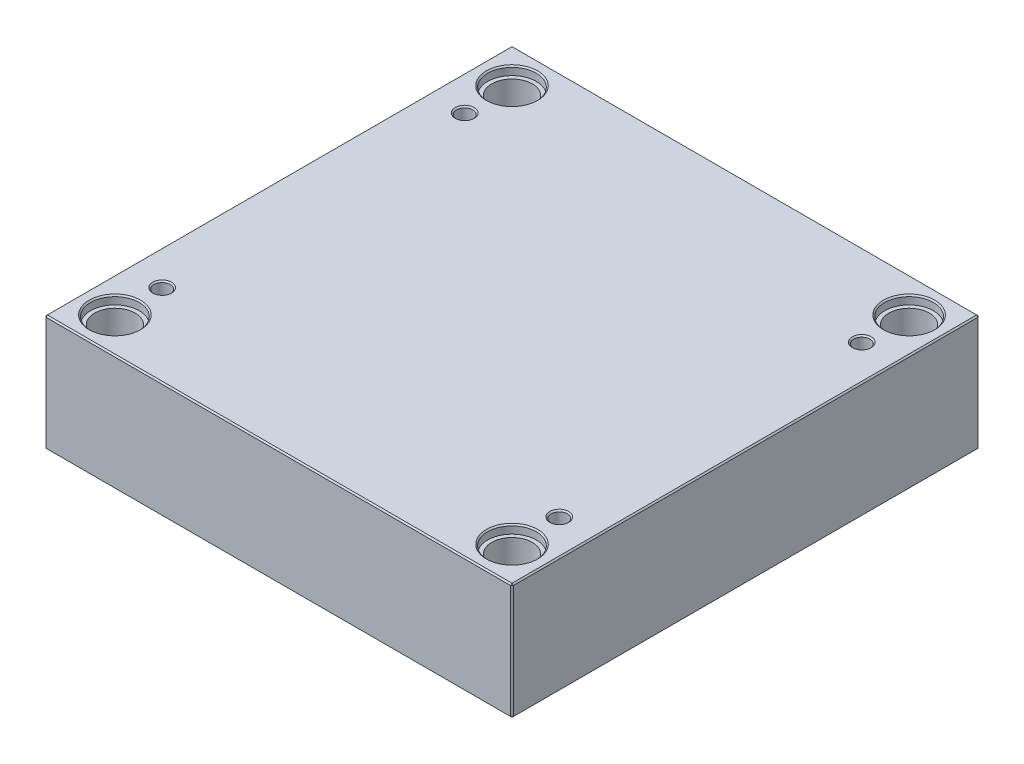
ISO-10303-21;
HEADER;
FILE_DESCRIPTION(('STEP AP214'),'2;1');
FILE_NAME('part.step','',(''),(''),'','','');
FILE_SCHEMA(('AUTOMOTIVE_DESIGN { 1 0 10303 214 1 1 1 1 }'));
ENDSEC;
DATA;
#1=APPLICATION_CONTEXT('core data for automotive mechanical design processes');
#2=APPLICATION_PROTOCOL_DEFINITION('international standard','automotive_design',2000,#1);
#3=PRODUCT_CONTEXT('',#1,'mechanical');
#4=PRODUCT('Part','Part','',(#3));
#5=PRODUCT_RELATED_PRODUCT_CATEGORY('part','',(#4));
#6=PRODUCT_DEFINITION_FORMATION('','',#4);
#7=PRODUCT_DEFINITION_CONTEXT('part definition',#1,'design');
#8=PRODUCT_DEFINITION('design','',#6,#7);
#9=PRODUCT_DEFINITION_SHAPE('','',#8);
#10=(LENGTH_UNIT() NAMED_UNIT(*) SI_UNIT(.MILLI.,.METRE.));
#11=(NAMED_UNIT(*) PLANE_ANGLE_UNIT() SI_UNIT($,.RADIAN.));
#12=(NAMED_UNIT(*) SI_UNIT($,.STERADIAN.) SOLID_ANGLE_UNIT());
#13=UNCERTAINTY_MEASURE_WITH_UNIT(LENGTH_MEASURE(1.E-05),#10,'distance_accuracy_value','');
#14=(GEOMETRIC_REPRESENTATION_CONTEXT(3) GLOBAL_UNCERTAINTY_ASSIGNED_CONTEXT((#13)) GLOBAL_UNIT_ASSIGNED_CONTEXT((#10,
#11,#12)) REPRESENTATION_CONTEXT('',''));
#15=CARTESIAN_POINT('',(0.,0.,0.));
#16=DIRECTION('',(0.,0.,1.));
#17=DIRECTION('',(1.,0.,0.));
#18=AXIS2_PLACEMENT_3D('',#15,#16,#17);
#19=CARTESIAN_POINT('',(-147.,0.,-147.));
#20=DIRECTION('',(0.,1.,0.));
#21=DIRECTION('',(0.,0.,1.));
#22=AXIS2_PLACEMENT_3D('',#19,#20,#21);
#23=CYLINDRICAL_SURFACE('',#22,15.);
#24=CARTESIAN_POINT('',(-147.,1.00000000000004,-147.));
#25=DIRECTION('',(0.,1.,0.));
#26=DIRECTION('',(0.,0.,1.));
#27=AXIS2_PLACEMENT_3D('',#24,#25,#26);
#28=CIRCLE('',#27,15.);
#29=CARTESIAN_POINT('',(-147.,1.00000000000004,-132.));
#30=VERTEX_POINT('',#29);
#31=EDGE_CURVE('E472',#30,#30,#28,.F.);
#32=ORIENTED_EDGE('',*,*,#31,.T.);
#33=EDGE_LOOP('',(#32));
#34=FACE_BOUND('',#33,.T.);
#35=CARTESIAN_POINT('',(-147.,79.7,-147.));
#36=DIRECTION('',(0.,1.,0.));
#37=DIRECTION('',(0.,0.,1.));
#38=AXIS2_PLACEMENT_3D('',#35,#36,#37);
#39=CIRCLE('',#38,15.);
#40=CARTESIAN_POINT('',(-147.,79.7,-132.));
#41=VERTEX_POINT('',#40);
#42=EDGE_CURVE('E221',#41,#41,#39,.F.);
#43=ORIENTED_EDGE('',*,*,#42,.F.);
#44=EDGE_LOOP('',(#43));
#45=FACE_BOUND('',#44,.T.);
#46=ADVANCED_FACE('F16',(#34,#45),#23,.F.);
#47=CARTESIAN_POINT('',(147.,0.,-147.));
#48=DIRECTION('',(0.,1.,0.));
#49=DIRECTION('',(0.,0.,1.));
#50=AXIS2_PLACEMENT_3D('',#47,#48,#49);
#51=CYLINDRICAL_SURFACE('',#50,15.);
#52=CARTESIAN_POINT('',(147.,1.00000000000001,-147.));
#53=DIRECTION('',(0.,1.,0.));
#54=DIRECTION('',(0.,0.,1.));
#55=AXIS2_PLACEMENT_3D('',#52,#53,#54);
#56=CIRCLE('',#55,15.);
#57=CARTESIAN_POINT('',(147.,1.00000000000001,-132.));
#58=VERTEX_POINT('',#57);
#59=EDGE_CURVE('E474',#58,#58,#56,.F.);
#60=ORIENTED_EDGE('',*,*,#59,.T.);
#61=EDGE_LOOP('',(#60));
#62=FACE_BOUND('',#61,.T.);
#63=CARTESIAN_POINT('',(147.,79.7,-147.));
#64=DIRECTION('',(0.,1.,0.));
#65=DIRECTION('',(0.,0.,1.));
#66=AXIS2_PLACEMENT_3D('',#63,#64,#65);
#67=CIRCLE('',#66,15.);
#68=CARTESIAN_POINT('',(147.,79.7,-132.));
#69=VERTEX_POINT('',#68);
#70=EDGE_CURVE('E218',#69,#69,#67,.F.);
#71=ORIENTED_EDGE('',*,*,#70,.F.);
#72=EDGE_LOOP('',(#71));
#73=FACE_BOUND('',#72,.T.);
#74=ADVANCED_FACE('F263',(#62,#73),#51,.F.);
#75=CARTESIAN_POINT('',(147.,0.,147.));
#76=DIRECTION('',(0.,1.,0.));
#77=DIRECTION('',(0.,0.,1.));
#78=AXIS2_PLACEMENT_3D('',#75,#76,#77);
#79=CYLINDRICAL_SURFACE('',#78,15.);
#80=CARTESIAN_POINT('',(147.,1.00000000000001,147.));
#81=DIRECTION('',(0.,1.,0.));
#82=DIRECTION('',(0.,0.,1.));
#83=AXIS2_PLACEMENT_3D('',#80,#81,#82);
#84=CIRCLE('',#83,15.);
#85=CARTESIAN_POINT('',(147.,1.00000000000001,162.));
#86=VERTEX_POINT('',#85);
#87=EDGE_CURVE('E477',#86,#86,#84,.F.);
#88=ORIENTED_EDGE('',*,*,#87,.T.);
#89=EDGE_LOOP('',(#88));
#90=FACE_BOUND('',#89,.T.);
#91=CARTESIAN_POINT('',(147.,79.7,147.));
#92=DIRECTION('',(0.,1.,0.));
#93=DIRECTION('',(0.,0.,1.));
#94=AXIS2_PLACEMENT_3D('',#91,#92,#93);
#95=CIRCLE('',#94,15.);
#96=CARTESIAN_POINT('',(147.,79.7,162.));
#97=VERTEX_POINT('',#96);
#98=EDGE_CURVE('E214',#97,#97,#95,.F.);
#99=ORIENTED_EDGE('',*,*,#98,.F.);
#100=EDGE_LOOP('',(#99));
#101=FACE_BOUND('',#100,.T.);
#102=ADVANCED_FACE('F270',(#90,#101),#79,.F.);
#103=CARTESIAN_POINT('',(-147.,0.,147.));
#104=DIRECTION('',(0.,1.,0.));
#105=DIRECTION('',(0.,0.,1.));
#106=AXIS2_PLACEMENT_3D('',#103,#104,#105);
#107=CYLINDRICAL_SURFACE('',#106,15.);
#108=CARTESIAN_POINT('',(-147.,1.00000000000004,147.));
#109=DIRECTION('',(0.,1.,0.));
#110=DIRECTION('',(0.,0.,1.));
#111=AXIS2_PLACEMENT_3D('',#108,#109,#110);
#112=CIRCLE('',#111,15.);
#113=CARTESIAN_POINT('',(-147.,1.00000000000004,162.));
#114=VERTEX_POINT('',#113);
#115=EDGE_CURVE('E480',#114,#114,#112,.F.);
#116=ORIENTED_EDGE('',*,*,#115,.T.);
#117=EDGE_LOOP('',(#116));
#118=FACE_BOUND('',#117,.T.);
#119=CARTESIAN_POINT('',(-147.,79.7,147.));
#120=DIRECTION('',(0.,1.,0.));
#121=DIRECTION('',(0.,0.,1.));
#122=AXIS2_PLACEMENT_3D('',#119,#120,#121);
#123=CIRCLE('',#122,15.);
#124=CARTESIAN_POINT('',(-147.,79.7,162.));
#125=VERTEX_POINT('',#124);
#126=EDGE_CURVE('E211',#125,#125,#123,.F.);
#127=ORIENTED_EDGE('',*,*,#126,.F.);
#128=EDGE_LOOP('',(#127));
#129=FACE_BOUND('',#128,.T.);
#130=ADVANCED_FACE('F277',(#118,#129),#107,.F.);
#131=CARTESIAN_POINT('',(-173.,86.,173.));
#132=DIRECTION('',(1.,0.,0.));
#133=DIRECTION('',(0.,0.,-1.));
#134=AXIS2_PLACEMENT_3D('',#131,#132,#133);
#135=PLANE('',#134);
#136=DIRECTION('',(0.,-1.,0.));
#137=VECTOR('',#136,1.);
#138=CARTESIAN_POINT('',(-173.,86.,-172.));
#139=LINE('',#138,#137);
#140=CARTESIAN_POINT('',(-173.,85.,-172.));
#141=VERTEX_POINT('',#140);
#142=CARTESIAN_POINT('',(-173.,1.00000000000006,-172.));
#143=VERTEX_POINT('',#142);
#144=EDGE_CURVE('E487',#141,#143,#139,.T.);
#145=ORIENTED_EDGE('',*,*,#144,.T.);
#146=DIRECTION('',(0.,0.,1.));
#147=VECTOR('',#146,1.);
#148=CARTESIAN_POINT('',(-173.,1.00000000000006,173.));
#149=LINE('',#148,#147);
#150=CARTESIAN_POINT('',(-173.,1.00000000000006,172.));
#151=VERTEX_POINT('',#150);
#152=EDGE_CURVE('E490',#143,#151,#149,.T.);
#153=ORIENTED_EDGE('',*,*,#152,.T.);
#154=DIRECTION('',(0.,1.,0.));
#155=VECTOR('',#154,1.);
#156=CARTESIAN_POINT('',(-173.,86.,172.));
#157=LINE('',#156,#155);
#158=CARTESIAN_POINT('',(-173.,85.,172.));
#159=VERTEX_POINT('',#158);
#160=EDGE_CURVE('E485',#151,#159,#157,.T.);
#161=ORIENTED_EDGE('',*,*,#160,.T.);
#162=DIRECTION('',(0.,0.,-1.));
#163=VECTOR('',#162,1.);
#164=CARTESIAN_POINT('',(-173.,85.,-173.));
#165=LINE('',#164,#163);
#166=EDGE_CURVE('E483',#159,#141,#165,.T.);
#167=ORIENTED_EDGE('',*,*,#166,.T.);
#168=EDGE_LOOP('',(#145,#153,#161,#167));
#169=FACE_BOUND('',#168,.T.);
#170=ADVANCED_FACE('F298',(#169),#135,.F.);
#171=CARTESIAN_POINT('',(173.,86.,173.));
#172=DIRECTION('',(0.,0.,-1.));
#173=DIRECTION('',(-1.,0.,0.));
#174=AXIS2_PLACEMENT_3D('',#171,#172,#173);
#175=PLANE('',#174);
#176=DIRECTION('',(-1.,0.,0.));
#177=VECTOR('',#176,1.);
#178=CARTESIAN_POINT('',(-173.,85.,173.));
#179=LINE('',#178,#177);
#180=CARTESIAN_POINT('',(172.,85.,173.));
#181=VERTEX_POINT('',#180);
#182=CARTESIAN_POINT('',(-172.,85.,173.));
#183=VERTEX_POINT('',#182);
#184=EDGE_CURVE('E509',#181,#183,#179,.T.);
#185=ORIENTED_EDGE('',*,*,#184,.T.);
#186=DIRECTION('',(0.,-1.,0.));
#187=VECTOR('',#186,1.);
#188=CARTESIAN_POINT('',(-172.,86.,173.));
#189=LINE('',#188,#187);
#190=CARTESIAN_POINT('',(-172.,1.00000000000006,173.));
#191=VERTEX_POINT('',#190);
#192=EDGE_CURVE('E515',#183,#191,#189,.T.);
#193=ORIENTED_EDGE('',*,*,#192,.T.);
#194=DIRECTION('',(1.,0.,0.));
#195=VECTOR('',#194,1.);
#196=CARTESIAN_POINT('',(173.,1.00000000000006,173.));
#197=LINE('',#196,#195);
#198=CARTESIAN_POINT('',(172.,1.00000000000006,173.));
#199=VERTEX_POINT('',#198);
#200=EDGE_CURVE('E513',#191,#199,#197,.T.);
#201=ORIENTED_EDGE('',*,*,#200,.T.);
#202=DIRECTION('',(0.,1.,0.));
#203=VECTOR('',#202,1.);
#204=CARTESIAN_POINT('',(172.,86.,173.));
#205=LINE('',#204,#203);
#206=EDGE_CURVE('E511',#199,#181,#205,.T.);
#207=ORIENTED_EDGE('',*,*,#206,.T.);
#208=EDGE_LOOP('',(#185,#193,#201,#207));
#209=FACE_BOUND('',#208,.T.);
#210=ADVANCED_FACE('F294',(#209),#175,.F.);
#211=CARTESIAN_POINT('',(173.,86.,173.));
#212=DIRECTION('',(-1.,0.,0.));
#213=DIRECTION('',(0.,0.,1.));
#214=AXIS2_PLACEMENT_3D('',#211,#212,#213);
#215=PLANE('',#214);
#216=DIRECTION('',(0.,0.,-1.));
#217=VECTOR('',#216,1.);
#218=CARTESIAN_POINT('',(173.,1.00000000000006,173.));
#219=LINE('',#218,#217);
#220=CARTESIAN_POINT('',(173.,1.00000000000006,172.));
#221=VERTEX_POINT('',#220);
#222=CARTESIAN_POINT('',(173.,1.00000000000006,-172.));
#223=VERTEX_POINT('',#222);
#224=EDGE_CURVE('E504',#221,#223,#219,.T.);
#225=ORIENTED_EDGE('',*,*,#224,.T.);
#226=DIRECTION('',(0.,1.,0.));
#227=VECTOR('',#226,1.);
#228=CARTESIAN_POINT('',(173.,86.,-172.));
#229=LINE('',#228,#227);
#230=CARTESIAN_POINT('',(173.,85.,-172.));
#231=VERTEX_POINT('',#230);
#232=EDGE_CURVE('E506',#223,#231,#229,.T.);
#233=ORIENTED_EDGE('',*,*,#232,.T.);
#234=DIRECTION('',(0.,0.,1.));
#235=VECTOR('',#234,1.);
#236=CARTESIAN_POINT('',(173.,85.,173.));
#237=LINE('',#236,#235);
#238=CARTESIAN_POINT('',(173.,85.,172.));
#239=VERTEX_POINT('',#238);
#240=EDGE_CURVE('E500',#231,#239,#237,.T.);
#241=ORIENTED_EDGE('',*,*,#240,.T.);
#242=DIRECTION('',(0.,-1.,0.));
#243=VECTOR('',#242,1.);
#244=CARTESIAN_POINT('',(173.,86.,172.));
#245=LINE('',#244,#243);
#246=EDGE_CURVE('E502',#239,#221,#245,.T.);
#247=ORIENTED_EDGE('',*,*,#246,.T.);
#248=EDGE_LOOP('',(#225,#233,#241,#247));
#249=FACE_BOUND('',#248,.T.);
#250=ADVANCED_FACE('F290',(#249),#215,.F.);
#251=CARTESIAN_POINT('',(173.,86.,-173.));
#252=DIRECTION('',(0.,0.,1.));
#253=DIRECTION('',(1.,0.,0.));
#254=AXIS2_PLACEMENT_3D('',#251,#252,#253);
#255=PLANE('',#254);
#256=DIRECTION('',(0.,-1.,0.));
#257=VECTOR('',#256,1.);
#258=CARTESIAN_POINT('',(172.,86.,-173.));
#259=LINE('',#258,#257);
#260=CARTESIAN_POINT('',(172.,85.,-173.));
#261=VERTEX_POINT('',#260);
#262=CARTESIAN_POINT('',(172.,1.00000000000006,-173.));
#263=VERTEX_POINT('',#262);
#264=EDGE_CURVE('E494',#261,#263,#259,.T.);
#265=ORIENTED_EDGE('',*,*,#264,.T.);
#266=DIRECTION('',(-1.,0.,0.));
#267=VECTOR('',#266,1.);
#268=CARTESIAN_POINT('',(173.,1.00000000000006,-173.));
#269=LINE('',#268,#267);
#270=CARTESIAN_POINT('',(-172.,1.00000000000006,-173.));
#271=VERTEX_POINT('',#270);
#272=EDGE_CURVE('E138',#263,#271,#269,.T.);
#273=ORIENTED_EDGE('',*,*,#272,.T.);
#274=DIRECTION('',(0.,1.,0.));
#275=VECTOR('',#274,1.);
#276=CARTESIAN_POINT('',(-172.,86.,-173.));
#277=LINE('',#276,#275);
#278=CARTESIAN_POINT('',(-172.,85.,-173.));
#279=VERTEX_POINT('',#278);
#280=EDGE_CURVE('E496',#271,#279,#277,.T.);
#281=ORIENTED_EDGE('',*,*,#280,.T.);
#282=DIRECTION('',(1.,0.,0.));
#283=VECTOR('',#282,1.);
#284=CARTESIAN_POINT('',(173.,85.,-173.));
#285=LINE('',#284,#283);
#286=EDGE_CURVE('E492',#279,#261,#285,.T.);
#287=ORIENTED_EDGE('',*,*,#286,.T.);
#288=EDGE_LOOP('',(#265,#273,#281,#287));
#289=FACE_BOUND('',#288,.T.);
#290=ADVANCED_FACE('F282',(#289),#255,.F.);
#291=CARTESIAN_POINT('',(0.,86.,0.));
#292=DIRECTION('',(0.,1.,0.));
#293=DIRECTION('',(0.,0.,1.));
#294=AXIS2_PLACEMENT_3D('',#291,#292,#293);
#295=PLANE('',#294);
#296=CARTESIAN_POINT('',(147.,86.,147.));
#297=DIRECTION('',(0.,1.,0.));
#298=DIRECTION('',(0.,0.,1.));
#299=AXIS2_PLACEMENT_3D('',#296,#297,#298);
#300=CIRCLE('',#299,19.);
#301=CARTESIAN_POINT('',(147.,86.,166.));
#302=VERTEX_POINT('',#301);
#303=EDGE_CURVE('E236',#302,#302,#300,.F.);
#304=ORIENTED_EDGE('',*,*,#303,.T.);
#305=EDGE_LOOP('',(#304));
#306=FACE_BOUND('',#305,.T.);
#307=CARTESIAN_POINT('',(-147.,86.,147.));
#308=DIRECTION('',(0.,1.,0.));
#309=DIRECTION('',(0.,0.,1.));
#310=AXIS2_PLACEMENT_3D('',#307,#308,#309);
#311=CIRCLE('',#310,19.);
#312=CARTESIAN_POINT('',(-147.,86.,166.));
#313=VERTEX_POINT('',#312);
#314=EDGE_CURVE('E233',#313,#313,#311,.F.);
#315=ORIENTED_EDGE('',*,*,#314,.T.);
#316=EDGE_LOOP('',(#315));
#317=FACE_BOUND('',#316,.T.);
#318=CARTESIAN_POINT('',(147.,86.,-147.));
#319=DIRECTION('',(0.,1.,0.));
#320=DIRECTION('',(0.,0.,1.));
#321=AXIS2_PLACEMENT_3D('',#318,#319,#320);
#322=CIRCLE('',#321,19.);
#323=CARTESIAN_POINT('',(147.,86.,-128.));
#324=VERTEX_POINT('',#323);
#325=EDGE_CURVE('E230',#324,#324,#322,.F.);
#326=ORIENTED_EDGE('',*,*,#325,.T.);
#327=EDGE_LOOP('',(#326));
#328=FACE_BOUND('',#327,.T.);
#329=CARTESIAN_POINT('',(-147.,86.,-147.));
#330=DIRECTION('',(0.,1.,0.));
#331=DIRECTION('',(0.,0.,1.));
#332=AXIS2_PLACEMENT_3D('',#329,#330,#331);
#333=CIRCLE('',#332,19.);
#334=CARTESIAN_POINT('',(-147.,86.,-128.));
#335=VERTEX_POINT('',#334);
#336=EDGE_CURVE('E227',#335,#335,#333,.F.);
#337=ORIENTED_EDGE('',*,*,#336,.T.);
#338=EDGE_LOOP('',(#337));
#339=FACE_BOUND('',#338,.T.);
#340=CARTESIAN_POINT('',(-147.,86.,112.));
#341=DIRECTION('',(0.,1.,0.));
#342=DIRECTION('',(0.,0.,1.));
#343=AXIS2_PLACEMENT_3D('',#340,#341,#342);
#344=CIRCLE('',#343,7.);
#345=CARTESIAN_POINT('',(-147.,86.,119.));
#346=VERTEX_POINT('',#345);
#347=EDGE_CURVE('E198',#346,#346,#344,.F.);
#348=ORIENTED_EDGE('',*,*,#347,.T.);
#349=EDGE_LOOP('',(#348));
#350=FACE_BOUND('',#349,.T.);
#351=CARTESIAN_POINT('',(147.,86.,112.));
#352=DIRECTION('',(0.,1.,0.));
#353=DIRECTION('',(0.,0.,1.));
#354=AXIS2_PLACEMENT_3D('',#351,#352,#353);
#355=CIRCLE('',#354,7.);
#356=CARTESIAN_POINT('',(147.,86.,119.));
#357=VERTEX_POINT('',#356);
#358=EDGE_CURVE('E195',#357,#357,#355,.F.);
#359=ORIENTED_EDGE('',*,*,#358,.T.);
#360=EDGE_LOOP('',(#359));
#361=FACE_BOUND('',#360,.T.);
#362=CARTESIAN_POINT('',(147.,86.,-112.));
#363=DIRECTION('',(0.,1.,0.));
#364=DIRECTION('',(0.,0.,1.));
#365=AXIS2_PLACEMENT_3D('',#362,#363,#364);
#366=CIRCLE('',#365,7.);
#367=CARTESIAN_POINT('',(147.,86.,-105.));
#368=VERTEX_POINT('',#367);
#369=EDGE_CURVE('E192',#368,#368,#366,.F.);
#370=ORIENTED_EDGE('',*,*,#369,.T.);
#371=EDGE_LOOP('',(#370));
#372=FACE_BOUND('',#371,.T.);
#373=CARTESIAN_POINT('',(-147.,86.,-112.));
#374=DIRECTION('',(0.,1.,0.));
#375=DIRECTION('',(0.,0.,1.));
#376=AXIS2_PLACEMENT_3D('',#373,#374,#375);
#377=CIRCLE('',#376,7.);
#378=CARTESIAN_POINT('',(-147.,86.,-105.));
#379=VERTEX_POINT('',#378);
#380=EDGE_CURVE('E188',#379,#379,#377,.F.);
#381=ORIENTED_EDGE('',*,*,#380,.T.);
#382=EDGE_LOOP('',(#381));
#383=FACE_BOUND('',#382,.T.);
#384=DIRECTION('',(0.,0.,-1.));
#385=VECTOR('',#384,1.);
#386=CARTESIAN_POINT('',(172.,86.,-173.));
#387=LINE('',#386,#385);
#388=CARTESIAN_POINT('',(172.,86.,172.));
#389=VERTEX_POINT('',#388);
#390=CARTESIAN_POINT('',(172.,86.,-172.));
#391=VERTEX_POINT('',#390);
#392=EDGE_CURVE('E31',#389,#391,#387,.T.);
#393=ORIENTED_EDGE('',*,*,#392,.T.);
#394=DIRECTION('',(-1.,0.,0.));
#395=VECTOR('',#394,1.);
#396=CARTESIAN_POINT('',(-173.,86.,-172.));
#397=LINE('',#396,#395);
#398=CARTESIAN_POINT('',(-172.,86.,-172.));
#399=VERTEX_POINT('',#398);
#400=EDGE_CURVE('E189',#391,#399,#397,.T.);
#401=ORIENTED_EDGE('',*,*,#400,.T.);
#402=DIRECTION('',(0.,0.,1.));
#403=VECTOR('',#402,1.);
#404=CARTESIAN_POINT('',(-172.,86.,173.));
#405=LINE('',#404,#403);
#406=CARTESIAN_POINT('',(-172.,86.,172.));
#407=VERTEX_POINT('',#406);
#408=EDGE_CURVE('E518',#399,#407,#405,.T.);
#409=ORIENTED_EDGE('',*,*,#408,.T.);
#410=DIRECTION('',(1.,0.,0.));
#411=VECTOR('',#410,1.);
#412=CARTESIAN_POINT('',(173.,86.,172.));
#413=LINE('',#412,#411);
#414=EDGE_CURVE('E36',#407,#389,#413,.T.);
#415=ORIENTED_EDGE('',*,*,#414,.T.);
#416=EDGE_LOOP('',(#393,#401,#409,#415));
#417=FACE_BOUND('',#416,.T.);
#418=ADVANCED_FACE('F279',(#306,#317,#328,#339,#350,#361,#372,#383,#417),#295,.T.);
#419=CARTESIAN_POINT('',(0.,0.,0.));
#420=DIRECTION('',(0.,1.,0.));
#421=DIRECTION('',(0.,0.,1.));
#422=AXIS2_PLACEMENT_3D('',#419,#420,#421);
#423=PLANE('',#422);
#424=CARTESIAN_POINT('',(-147.,0.,-147.));
#425=DIRECTION('',(0.,1.,0.));
#426=DIRECTION('',(0.,0.,1.));
#427=AXIS2_PLACEMENT_3D('',#424,#425,#426);
#428=CIRCLE('',#427,16.);
#429=CARTESIAN_POINT('',(-147.,0.,-131.));
#430=VERTEX_POINT('',#429);
#431=EDGE_CURVE('E469',#430,#430,#428,.T.);
#432=ORIENTED_EDGE('',*,*,#431,.T.);
#433=EDGE_LOOP('',(#432));
#434=FACE_BOUND('',#433,.T.);
#435=CARTESIAN_POINT('',(147.,0.,-147.));
#436=DIRECTION('',(0.,1.,0.));
#437=DIRECTION('',(0.,0.,1.));
#438=AXIS2_PLACEMENT_3D('',#435,#436,#437);
#439=CIRCLE('',#438,16.);
#440=CARTESIAN_POINT('',(147.,0.,-131.));
#441=VERTEX_POINT('',#440);
#442=EDGE_CURVE('E466',#441,#441,#439,.T.);
#443=ORIENTED_EDGE('',*,*,#442,.T.);
#444=EDGE_LOOP('',(#443));
#445=FACE_BOUND('',#444,.T.);
#446=CARTESIAN_POINT('',(147.,0.,147.));
#447=DIRECTION('',(0.,1.,0.));
#448=DIRECTION('',(0.,0.,1.));
#449=AXIS2_PLACEMENT_3D('',#446,#447,#448);
#450=CIRCLE('',#449,16.);
#451=CARTESIAN_POINT('',(147.,0.,163.));
#452=VERTEX_POINT('',#451);
#453=EDGE_CURVE('E463',#452,#452,#450,.T.);
#454=ORIENTED_EDGE('',*,*,#453,.T.);
#455=EDGE_LOOP('',(#454));
#456=FACE_BOUND('',#455,.T.);
#457=CARTESIAN_POINT('',(-147.,0.,147.));
#458=DIRECTION('',(0.,1.,0.));
#459=DIRECTION('',(0.,0.,1.));
#460=AXIS2_PLACEMENT_3D('',#457,#458,#459);
#461=CIRCLE('',#460,16.);
#462=CARTESIAN_POINT('',(-147.,0.,163.));
#463=VERTEX_POINT('',#462);
#464=EDGE_CURVE('E460',#463,#463,#461,.T.);
#465=ORIENTED_EDGE('',*,*,#464,.T.);
#466=EDGE_LOOP('',(#465));
#467=FACE_BOUND('',#466,.T.);
#468=DIRECTION('',(0.,0.,1.));
#469=VECTOR('',#468,1.);
#470=CARTESIAN_POINT('',(172.,0.,0.));
#471=LINE('',#470,#469);
#472=CARTESIAN_POINT('',(172.,0.,-172.));
#473=VERTEX_POINT('',#472);
#474=CARTESIAN_POINT('',(172.,0.,172.));
#475=VERTEX_POINT('',#474);
#476=EDGE_CURVE('E108',#473,#475,#471,.T.);
#477=ORIENTED_EDGE('',*,*,#476,.T.);
#478=DIRECTION('',(-1.,0.,0.));
#479=VECTOR('',#478,1.);
#480=CARTESIAN_POINT('',(0.,0.,172.));
#481=LINE('',#480,#479);
#482=CARTESIAN_POINT('',(-172.,0.,172.));
#483=VERTEX_POINT('',#482);
#484=EDGE_CURVE('E458',#475,#483,#481,.T.);
#485=ORIENTED_EDGE('',*,*,#484,.T.);
#486=DIRECTION('',(0.,0.,-1.));
#487=VECTOR('',#486,1.);
#488=CARTESIAN_POINT('',(-172.,0.,0.));
#489=LINE('',#488,#487);
#490=CARTESIAN_POINT('',(-172.,0.,-172.));
#491=VERTEX_POINT('',#490);
#492=EDGE_CURVE('E110',#483,#491,#489,.T.);
#493=ORIENTED_EDGE('',*,*,#492,.T.);
#494=DIRECTION('',(1.,0.,0.));
#495=VECTOR('',#494,1.);
#496=CARTESIAN_POINT('',(0.,0.,-172.));
#497=LINE('',#496,#495);
#498=EDGE_CURVE('E104',#491,#473,#497,.T.);
#499=ORIENTED_EDGE('',*,*,#498,.T.);
#500=EDGE_LOOP('',(#477,#485,#493,#499));
#501=FACE_BOUND('',#500,.T.);
#502=ADVANCED_FACE('F106',(#434,#445,#456,#467,#501),#423,.F.);
#503=CARTESIAN_POINT('',(-147.,0.,-147.));
#504=DIRECTION('',(0.,-1.,0.));
#505=DIRECTION('',(0.,0.,-1.));
#506=AXIS2_PLACEMENT_3D('',#503,#504,#505);
#507=CONICAL_SURFACE('',#506,16.,0.785398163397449);
#508=ORIENTED_EDGE('',*,*,#31,.F.);
#509=EDGE_LOOP('',(#508));
#510=FACE_BOUND('',#509,.T.);
#511=ORIENTED_EDGE('',*,*,#431,.F.);
#512=EDGE_LOOP('',(#511));
#513=FACE_BOUND('',#512,.T.);
#514=ADVANCED_FACE('F286',(#510,#513),#507,.F.);
#515=CARTESIAN_POINT('',(147.,0.,-147.));
#516=DIRECTION('',(0.,-1.,0.));
#517=DIRECTION('',(0.,0.,-1.));
#518=AXIS2_PLACEMENT_3D('',#515,#516,#517);
#519=CONICAL_SURFACE('',#518,16.,0.785398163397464);
#520=ORIENTED_EDGE('',*,*,#59,.F.);
#521=EDGE_LOOP('',(#520));
#522=FACE_BOUND('',#521,.T.);
#523=ORIENTED_EDGE('',*,*,#442,.F.);
#524=EDGE_LOOP('',(#523));
#525=FACE_BOUND('',#524,.T.);
#526=ADVANCED_FACE('F305',(#522,#525),#519,.F.);
#527=CARTESIAN_POINT('',(147.,0.,147.));
#528=DIRECTION('',(0.,-1.,0.));
#529=DIRECTION('',(0.,0.,-1.));
#530=AXIS2_PLACEMENT_3D('',#527,#528,#529);
#531=CONICAL_SURFACE('',#530,16.,0.78539816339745);
#532=ORIENTED_EDGE('',*,*,#87,.F.);
#533=EDGE_LOOP('',(#532));
#534=FACE_BOUND('',#533,.T.);
#535=ORIENTED_EDGE('',*,*,#453,.F.);
#536=EDGE_LOOP('',(#535));
#537=FACE_BOUND('',#536,.T.);
#538=ADVANCED_FACE('F309',(#534,#537),#531,.F.);
#539=CARTESIAN_POINT('',(-147.,0.,147.));
#540=DIRECTION('',(0.,-1.,0.));
#541=DIRECTION('',(0.,0.,-1.));
#542=AXIS2_PLACEMENT_3D('',#539,#540,#541);
#543=CONICAL_SURFACE('',#542,16.,0.785398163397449);
#544=ORIENTED_EDGE('',*,*,#115,.F.);
#545=EDGE_LOOP('',(#544));
#546=FACE_BOUND('',#545,.T.);
#547=ORIENTED_EDGE('',*,*,#464,.F.);
#548=EDGE_LOOP('',(#547));
#549=FACE_BOUND('',#548,.T.);
#550=ADVANCED_FACE('F313',(#546,#549),#543,.F.);
#551=CARTESIAN_POINT('',(173.,86.,172.));
#552=DIRECTION('',(-0.707106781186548,0.,-0.707106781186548));
#553=DIRECTION('',(0.,-1.,0.));
#554=AXIS2_PLACEMENT_3D('',#551,#552,#553);
#555=PLANE('',#554);
#556=DIRECTION('',(-0.707106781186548,0.,0.707106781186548));
#557=VECTOR('',#556,1.);
#558=CARTESIAN_POINT('',(172.,85.,173.));
#559=LINE('',#558,#557);
#560=EDGE_CURVE('E126',#181,#239,#559,.F.);
#561=ORIENTED_EDGE('',*,*,#560,.F.);
#562=ORIENTED_EDGE('',*,*,#206,.F.);
#563=DIRECTION('',(0.707106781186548,0.,-0.707106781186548));
#564=VECTOR('',#563,1.);
#565=CARTESIAN_POINT('',(172.,1.00000000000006,173.));
#566=LINE('',#565,#564);
#567=EDGE_CURVE('E180',#221,#199,#566,.F.);
#568=ORIENTED_EDGE('',*,*,#567,.F.);
#569=ORIENTED_EDGE('',*,*,#246,.F.);
#570=EDGE_LOOP('',(#561,#562,#568,#569));
#571=FACE_BOUND('',#570,.T.);
#572=ADVANCED_FACE('F317',(#571),#555,.F.);
#573=CARTESIAN_POINT('',(172.,85.,173.));
#574=DIRECTION('',(0.577350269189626,0.577350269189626,0.577350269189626));
#575=DIRECTION('',(0.707106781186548,0.,-0.707106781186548));
#576=AXIS2_PLACEMENT_3D('',#573,#574,#575);
#577=PLANE('',#576);
#578=DIRECTION('',(0.,-0.707106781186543,0.707106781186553));
#579=VECTOR('',#578,1.);
#580=CARTESIAN_POINT('',(172.,85.,173.));
#581=LINE('',#580,#579);
#582=EDGE_CURVE('E175',#181,#389,#581,.F.);
#583=ORIENTED_EDGE('',*,*,#582,.F.);
#584=ORIENTED_EDGE('',*,*,#560,.T.);
#585=DIRECTION('',(-0.707106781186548,0.707106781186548,0.));
#586=VECTOR('',#585,1.);
#587=CARTESIAN_POINT('',(172.5,85.5,172.));
#588=LINE('',#587,#586);
#589=EDGE_CURVE('E177',#389,#239,#588,.F.);
#590=ORIENTED_EDGE('',*,*,#589,.F.);
#591=EDGE_LOOP('',(#583,#584,#590));
#592=FACE_BOUND('',#591,.T.);
#593=ADVANCED_FACE('F385',(#592),#577,.T.);
#594=CARTESIAN_POINT('',(172.,1.00000000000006,173.));
#595=DIRECTION('',(0.577350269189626,-0.577350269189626,0.577350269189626));
#596=DIRECTION('',(0.707106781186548,0.,-0.707106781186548));
#597=AXIS2_PLACEMENT_3D('',#594,#595,#596);
#598=PLANE('',#597);
#599=DIRECTION('',(-0.707106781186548,-0.707106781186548,0.));
#600=VECTOR('',#599,1.);
#601=CARTESIAN_POINT('',(172.5,0.500000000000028,172.));
#602=LINE('',#601,#600);
#603=EDGE_CURVE('E124',#221,#475,#602,.T.);
#604=ORIENTED_EDGE('',*,*,#603,.F.);
#605=ORIENTED_EDGE('',*,*,#567,.T.);
#606=DIRECTION('',(0.,0.707106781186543,0.707106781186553));
#607=VECTOR('',#606,1.);
#608=CARTESIAN_POINT('',(172.,1.00000000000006,173.));
#609=LINE('',#608,#607);
#610=EDGE_CURVE('E172',#475,#199,#609,.T.);
#611=ORIENTED_EDGE('',*,*,#610,.F.);
#612=EDGE_LOOP('',(#604,#605,#611));
#613=FACE_BOUND('',#612,.T.);
#614=ADVANCED_FACE('F381',(#613),#598,.T.);
#615=CARTESIAN_POINT('',(172.,86.,0.));
#616=DIRECTION('',(0.707106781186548,0.707106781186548,0.));
#617=DIRECTION('',(0.,0.,1.));
#618=AXIS2_PLACEMENT_3D('',#615,#616,#617);
#619=PLANE('',#618);
#620=ORIENTED_EDGE('',*,*,#589,.T.);
#621=ORIENTED_EDGE('',*,*,#240,.F.);
#622=DIRECTION('',(0.707106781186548,-0.707106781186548,0.));
#623=VECTOR('',#622,1.);
#624=CARTESIAN_POINT('',(173.,85.,-172.));
#625=LINE('',#624,#623);
#626=EDGE_CURVE('E166',#391,#231,#625,.T.);
#627=ORIENTED_EDGE('',*,*,#626,.F.);
#628=ORIENTED_EDGE('',*,*,#392,.F.);
#629=EDGE_LOOP('',(#620,#621,#627,#628));
#630=FACE_BOUND('',#629,.T.);
#631=ADVANCED_FACE('F377',(#630),#619,.T.);
#632=CARTESIAN_POINT('',(0.,86.,172.));
#633=DIRECTION('',(0.,0.707106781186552,0.707106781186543));
#634=DIRECTION('',(-1.,0.,0.));
#635=AXIS2_PLACEMENT_3D('',#632,#633,#634);
#636=PLANE('',#635);
#637=ORIENTED_EDGE('',*,*,#582,.T.);
#638=ORIENTED_EDGE('',*,*,#414,.F.);
#639=DIRECTION('',(0.,0.707106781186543,-0.707106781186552));
#640=VECTOR('',#639,1.);
#641=CARTESIAN_POINT('',(-172.,85.5,172.5));
#642=LINE('',#641,#640);
#643=EDGE_CURVE('E163',#183,#407,#642,.T.);
#644=ORIENTED_EDGE('',*,*,#643,.F.);
#645=ORIENTED_EDGE('',*,*,#184,.F.);
#646=EDGE_LOOP('',(#637,#638,#644,#645));
#647=FACE_BOUND('',#646,.T.);
#648=ADVANCED_FACE('F373',(#647),#636,.T.);
#649=CARTESIAN_POINT('',(-172.,86.,173.));
#650=DIRECTION('',(0.707106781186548,0.,-0.707106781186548));
#651=DIRECTION('',(0.,-1.,0.));
#652=AXIS2_PLACEMENT_3D('',#649,#650,#651);
#653=PLANE('',#652);
#654=DIRECTION('',(0.707106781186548,0.,0.707106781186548));
#655=VECTOR('',#654,1.);
#656=CARTESIAN_POINT('',(-172.,1.00000000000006,173.));
#657=LINE('',#656,#655);
#658=EDGE_CURVE('E157',#191,#151,#657,.F.);
#659=ORIENTED_EDGE('',*,*,#658,.F.);
#660=ORIENTED_EDGE('',*,*,#192,.F.);
#661=DIRECTION('',(-0.707106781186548,0.,-0.707106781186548));
#662=VECTOR('',#661,1.);
#663=CARTESIAN_POINT('',(-173.,85.,172.));
#664=LINE('',#663,#662);
#665=EDGE_CURVE('E160',#159,#183,#664,.F.);
#666=ORIENTED_EDGE('',*,*,#665,.F.);
#667=ORIENTED_EDGE('',*,*,#160,.F.);
#668=EDGE_LOOP('',(#659,#660,#666,#667));
#669=FACE_BOUND('',#668,.T.);
#670=ADVANCED_FACE('F369',(#669),#653,.F.);
#671=CARTESIAN_POINT('',(173.,1.00000000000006,173.));
#672=DIRECTION('',(0.,0.707106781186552,-0.707106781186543));
#673=DIRECTION('',(1.,0.,0.));
#674=AXIS2_PLACEMENT_3D('',#671,#672,#673);
#675=PLANE('',#674);
#676=ORIENTED_EDGE('',*,*,#610,.T.);
#677=ORIENTED_EDGE('',*,*,#200,.F.);
#678=DIRECTION('',(0.,-0.707106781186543,-0.707106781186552));
#679=VECTOR('',#678,1.);
#680=CARTESIAN_POINT('',(-172.,1.00000000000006,173.));
#681=LINE('',#680,#679);
#682=EDGE_CURVE('E135',#483,#191,#681,.F.);
#683=ORIENTED_EDGE('',*,*,#682,.F.);
#684=ORIENTED_EDGE('',*,*,#484,.F.);
#685=EDGE_LOOP('',(#676,#677,#683,#684));
#686=FACE_BOUND('',#685,.T.);
#687=ADVANCED_FACE('F366',(#686),#675,.F.);
#688=CARTESIAN_POINT('',(173.,1.00000000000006,173.));
#689=DIRECTION('',(-0.707106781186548,0.707106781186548,0.));
#690=DIRECTION('',(0.,0.,-1.));
#691=AXIS2_PLACEMENT_3D('',#688,#689,#690);
#692=PLANE('',#691);
#693=ORIENTED_EDGE('',*,*,#603,.T.);
#694=ORIENTED_EDGE('',*,*,#476,.F.);
#695=DIRECTION('',(0.707106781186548,0.707106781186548,0.));
#696=VECTOR('',#695,1.);
#697=CARTESIAN_POINT('',(172.5,0.500000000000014,-172.));
#698=LINE('',#697,#696);
#699=EDGE_CURVE('E121',#223,#473,#698,.F.);
#700=ORIENTED_EDGE('',*,*,#699,.F.);
#701=ORIENTED_EDGE('',*,*,#224,.F.);
#702=EDGE_LOOP('',(#693,#694,#700,#701));
#703=FACE_BOUND('',#702,.T.);
#704=ADVANCED_FACE('F119',(#703),#692,.F.);
#705=CARTESIAN_POINT('',(172.,86.,-173.));
#706=DIRECTION('',(-0.707106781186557,0.,0.707106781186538));
#707=DIRECTION('',(0.,-1.,0.));
#708=AXIS2_PLACEMENT_3D('',#705,#706,#707);
#709=PLANE('',#708);
#710=DIRECTION('',(0.707106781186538,0.,0.707106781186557));
#711=VECTOR('',#710,1.);
#712=CARTESIAN_POINT('',(173.,85.,-172.));
#713=LINE('',#712,#711);
#714=EDGE_CURVE('E168',#231,#261,#713,.F.);
#715=ORIENTED_EDGE('',*,*,#714,.F.);
#716=ORIENTED_EDGE('',*,*,#232,.F.);
#717=DIRECTION('',(-0.707106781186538,0.,-0.707106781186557));
#718=VECTOR('',#717,1.);
#719=CARTESIAN_POINT('',(172.,1.00000000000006,-173.));
#720=LINE('',#719,#718);
#721=EDGE_CURVE('E134',#263,#223,#720,.F.);
#722=ORIENTED_EDGE('',*,*,#721,.F.);
#723=ORIENTED_EDGE('',*,*,#264,.F.);
#724=EDGE_LOOP('',(#715,#716,#722,#723));
#725=FACE_BOUND('',#724,.T.);
#726=ADVANCED_FACE('F359',(#725),#709,.F.);
#727=CARTESIAN_POINT('',(173.,85.,-172.));
#728=DIRECTION('',(0.577350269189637,0.57735026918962,-0.57735026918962));
#729=DIRECTION('',(-0.707106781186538,0.,-0.707106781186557));
#730=AXIS2_PLACEMENT_3D('',#727,#728,#729);
#731=PLANE('',#730);
#732=ORIENTED_EDGE('',*,*,#626,.T.);
#733=ORIENTED_EDGE('',*,*,#714,.T.);
#734=DIRECTION('',(0.,0.707106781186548,0.707106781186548));
#735=VECTOR('',#734,1.);
#736=CARTESIAN_POINT('',(172.,85.5,-172.5));
#737=LINE('',#736,#735);
#738=EDGE_CURVE('E152',#391,#261,#737,.F.);
#739=ORIENTED_EDGE('',*,*,#738,.F.);
#740=EDGE_LOOP('',(#732,#733,#739));
#741=FACE_BOUND('',#740,.T.);
#742=ADVANCED_FACE('F355',(#741),#731,.T.);
#743=CARTESIAN_POINT('',(-173.,85.,172.));
#744=DIRECTION('',(-0.577350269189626,0.577350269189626,0.577350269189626));
#745=DIRECTION('',(0.707106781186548,0.,0.707106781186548));
#746=AXIS2_PLACEMENT_3D('',#743,#744,#745);
#747=PLANE('',#746);
#748=ORIENTED_EDGE('',*,*,#665,.T.);
#749=ORIENTED_EDGE('',*,*,#643,.T.);
#750=DIRECTION('',(-0.707106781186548,-0.707106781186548,0.));
#751=VECTOR('',#750,1.);
#752=CARTESIAN_POINT('',(-173.,85.,172.));
#753=LINE('',#752,#751);
#754=EDGE_CURVE('E143',#159,#407,#753,.F.);
#755=ORIENTED_EDGE('',*,*,#754,.F.);
#756=EDGE_LOOP('',(#748,#749,#755));
#757=FACE_BOUND('',#756,.T.);
#758=ADVANCED_FACE('F351',(#757),#747,.T.);
#759=CARTESIAN_POINT('',(-172.,1.00000000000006,173.));
#760=DIRECTION('',(-0.577350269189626,-0.577350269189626,0.577350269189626));
#761=DIRECTION('',(0.707106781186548,0.,0.707106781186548));
#762=AXIS2_PLACEMENT_3D('',#759,#760,#761);
#763=PLANE('',#762);
#764=ORIENTED_EDGE('',*,*,#682,.T.);
#765=ORIENTED_EDGE('',*,*,#658,.T.);
#766=DIRECTION('',(-0.707106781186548,0.707106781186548,0.));
#767=VECTOR('',#766,1.);
#768=CARTESIAN_POINT('',(-172.5,0.500000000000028,172.));
#769=LINE('',#768,#767);
#770=EDGE_CURVE('E139',#483,#151,#769,.T.);
#771=ORIENTED_EDGE('',*,*,#770,.F.);
#772=EDGE_LOOP('',(#764,#765,#771));
#773=FACE_BOUND('',#772,.T.);
#774=ADVANCED_FACE('F348',(#773),#763,.T.);
#775=CARTESIAN_POINT('',(172.,1.00000000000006,-173.));
#776=DIRECTION('',(0.577350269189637,-0.57735026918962,-0.57735026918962));
#777=DIRECTION('',(-0.707106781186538,0.,-0.707106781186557));
#778=AXIS2_PLACEMENT_3D('',#775,#776,#777);
#779=PLANE('',#778);
#780=ORIENTED_EDGE('',*,*,#721,.T.);
#781=ORIENTED_EDGE('',*,*,#699,.T.);
#782=DIRECTION('',(0.,-0.707106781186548,0.707106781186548));
#783=VECTOR('',#782,1.);
#784=CARTESIAN_POINT('',(172.,1.00000000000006,-173.));
#785=LINE('',#784,#783);
#786=EDGE_CURVE('E131',#263,#473,#785,.T.);
#787=ORIENTED_EDGE('',*,*,#786,.F.);
#788=EDGE_LOOP('',(#780,#781,#787));
#789=FACE_BOUND('',#788,.T.);
#790=ADVANCED_FACE('F130',(#789),#779,.T.);
#791=CARTESIAN_POINT('',(0.,86.,-172.));
#792=DIRECTION('',(0.,0.707106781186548,-0.707106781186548));
#793=DIRECTION('',(1.,0.,0.));
#794=AXIS2_PLACEMENT_3D('',#791,#792,#793);
#795=PLANE('',#794);
#796=ORIENTED_EDGE('',*,*,#738,.T.);
#797=ORIENTED_EDGE('',*,*,#286,.F.);
#798=DIRECTION('',(0.,-0.707106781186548,-0.707106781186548));
#799=VECTOR('',#798,1.);
#800=CARTESIAN_POINT('',(-172.,85.,-173.));
#801=LINE('',#800,#799);
#802=EDGE_CURVE('E140',#399,#279,#801,.T.);
#803=ORIENTED_EDGE('',*,*,#802,.F.);
#804=ORIENTED_EDGE('',*,*,#400,.F.);
#805=EDGE_LOOP('',(#796,#797,#803,#804));
#806=FACE_BOUND('',#805,.T.);
#807=ADVANCED_FACE('F341',(#806),#795,.T.);
#808=CARTESIAN_POINT('',(-172.,86.,0.));
#809=DIRECTION('',(-0.707106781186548,0.707106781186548,0.));
#810=DIRECTION('',(0.,0.,-1.));
#811=AXIS2_PLACEMENT_3D('',#808,#809,#810);
#812=PLANE('',#811);
#813=ORIENTED_EDGE('',*,*,#754,.T.);
#814=ORIENTED_EDGE('',*,*,#408,.F.);
#815=DIRECTION('',(0.707106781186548,0.707106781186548,0.));
#816=VECTOR('',#815,1.);
#817=CARTESIAN_POINT('',(-172.5,85.5,-172.));
#818=LINE('',#817,#816);
#819=EDGE_CURVE('E146',#141,#399,#818,.T.);
#820=ORIENTED_EDGE('',*,*,#819,.F.);
#821=ORIENTED_EDGE('',*,*,#166,.F.);
#822=EDGE_LOOP('',(#813,#814,#820,#821));
#823=FACE_BOUND('',#822,.T.);
#824=ADVANCED_FACE('F337',(#823),#812,.T.);
#825=CARTESIAN_POINT('',(-173.,1.00000000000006,173.));
#826=DIRECTION('',(0.707106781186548,0.707106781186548,0.));
#827=DIRECTION('',(0.,0.,1.));
#828=AXIS2_PLACEMENT_3D('',#825,#826,#827);
#829=PLANE('',#828);
#830=ORIENTED_EDGE('',*,*,#770,.T.);
#831=ORIENTED_EDGE('',*,*,#152,.F.);
#832=DIRECTION('',(0.707106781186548,-0.707106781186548,0.));
#833=VECTOR('',#832,1.);
#834=CARTESIAN_POINT('',(-173.,1.00000000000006,-172.));
#835=LINE('',#834,#833);
#836=EDGE_CURVE('E529',#491,#143,#835,.F.);
#837=ORIENTED_EDGE('',*,*,#836,.F.);
#838=ORIENTED_EDGE('',*,*,#492,.F.);
#839=EDGE_LOOP('',(#830,#831,#837,#838));
#840=FACE_BOUND('',#839,.T.);
#841=ADVANCED_FACE('F334',(#840),#829,.F.);
#842=CARTESIAN_POINT('',(173.,1.00000000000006,-173.));
#843=DIRECTION('',(0.,0.707106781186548,0.707106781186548));
#844=DIRECTION('',(-1.,0.,0.));
#845=AXIS2_PLACEMENT_3D('',#842,#843,#844);
#846=PLANE('',#845);
#847=ORIENTED_EDGE('',*,*,#786,.T.);
#848=ORIENTED_EDGE('',*,*,#498,.F.);
#849=DIRECTION('',(0.,0.707106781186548,-0.707106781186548));
#850=VECTOR('',#849,1.);
#851=CARTESIAN_POINT('',(-172.,0.500000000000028,-172.5));
#852=LINE('',#851,#850);
#853=EDGE_CURVE('E526',#271,#491,#852,.F.);
#854=ORIENTED_EDGE('',*,*,#853,.F.);
#855=ORIENTED_EDGE('',*,*,#272,.F.);
#856=EDGE_LOOP('',(#847,#848,#854,#855));
#857=FACE_BOUND('',#856,.T.);
#858=ADVANCED_FACE('F137',(#857),#846,.F.);
#859=CARTESIAN_POINT('',(-172.,85.,-173.));
#860=DIRECTION('',(-0.577350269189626,0.577350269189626,-0.577350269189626));
#861=DIRECTION('',(-0.707106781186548,0.,0.707106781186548));
#862=AXIS2_PLACEMENT_3D('',#859,#860,#861);
#863=PLANE('',#862);
#864=ORIENTED_EDGE('',*,*,#819,.T.);
#865=ORIENTED_EDGE('',*,*,#802,.T.);
#866=DIRECTION('',(0.707106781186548,0.,-0.707106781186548));
#867=VECTOR('',#866,1.);
#868=CARTESIAN_POINT('',(-172.,85.,-173.));
#869=LINE('',#868,#867);
#870=EDGE_CURVE('E524',#141,#279,#869,.T.);
#871=ORIENTED_EDGE('',*,*,#870,.F.);
#872=EDGE_LOOP('',(#864,#865,#871));
#873=FACE_BOUND('',#872,.T.);
#874=ADVANCED_FACE('F327',(#873),#863,.T.);
#875=CARTESIAN_POINT('',(-173.,1.00000000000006,-172.));
#876=DIRECTION('',(-0.577350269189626,-0.577350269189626,-0.577350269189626));
#877=DIRECTION('',(-0.707106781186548,0.,0.707106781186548));
#878=AXIS2_PLACEMENT_3D('',#875,#876,#877);
#879=PLANE('',#878);
#880=ORIENTED_EDGE('',*,*,#853,.T.);
#881=ORIENTED_EDGE('',*,*,#836,.T.);
#882=DIRECTION('',(-0.707106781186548,0.,0.707106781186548));
#883=VECTOR('',#882,1.);
#884=CARTESIAN_POINT('',(-173.,1.00000000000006,-172.));
#885=LINE('',#884,#883);
#886=EDGE_CURVE('E455',#271,#143,#885,.T.);
#887=ORIENTED_EDGE('',*,*,#886,.F.);
#888=EDGE_LOOP('',(#880,#881,#887));
#889=FACE_BOUND('',#888,.T.);
#890=ADVANCED_FACE('F323',(#889),#879,.T.);
#891=CARTESIAN_POINT('',(-173.,86.,-172.));
#892=DIRECTION('',(0.707106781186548,0.,0.707106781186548));
#893=DIRECTION('',(0.,-1.,0.));
#894=AXIS2_PLACEMENT_3D('',#891,#892,#893);
#895=PLANE('',#894);
#896=ORIENTED_EDGE('',*,*,#870,.T.);
#897=ORIENTED_EDGE('',*,*,#280,.F.);
#898=ORIENTED_EDGE('',*,*,#886,.T.);
#899=ORIENTED_EDGE('',*,*,#144,.F.);
#900=EDGE_LOOP('',(#896,#897,#898,#899));
#901=FACE_BOUND('',#900,.T.);
#902=ADVANCED_FACE('F319',(#901),#895,.F.);
#903=CARTESIAN_POINT('',(-147.,62.,-112.));
#904=DIRECTION('',(0.,1.,0.));
#905=DIRECTION('',(0.,0.,1.));
#906=AXIS2_PLACEMENT_3D('',#903,#904,#905);
#907=CYLINDRICAL_SURFACE('',#906,6.);
#908=CARTESIAN_POINT('',(-147.,85.,-112.));
#909=DIRECTION('',(0.,1.,0.));
#910=DIRECTION('',(0.,0.,1.));
#911=AXIS2_PLACEMENT_3D('',#908,#909,#910);
#912=CIRCLE('',#911,6.);
#913=CARTESIAN_POINT('',(-147.,85.,-106.));
#914=VERTEX_POINT('',#913);
#915=EDGE_CURVE('E207',#914,#914,#912,.T.);
#916=ORIENTED_EDGE('',*,*,#915,.T.);
#917=EDGE_LOOP('',(#916));
#918=FACE_BOUND('',#917,.T.);
#919=CARTESIAN_POINT('',(-147.,62.,-112.));
#920=DIRECTION('',(0.,1.,0.));
#921=DIRECTION('',(0.,0.,1.));
#922=AXIS2_PLACEMENT_3D('',#919,#920,#921);
#923=CIRCLE('',#922,6.);
#924=CARTESIAN_POINT('',(-147.,62.,-106.));
#925=VERTEX_POINT('',#924);
#926=EDGE_CURVE('E448',#925,#925,#923,.T.);
#927=ORIENTED_EDGE('',*,*,#926,.F.);
#928=EDGE_LOOP('',(#927));
#929=FACE_BOUND('',#928,.T.);
#930=ADVANCED_FACE('F322',(#918,#929),#907,.F.);
#931=CARTESIAN_POINT('',(-147.,62.,-112.));
#932=DIRECTION('',(0.,1.,0.));
#933=DIRECTION('',(0.,0.,1.));
#934=AXIS2_PLACEMENT_3D('',#931,#932,#933);
#935=PLANE('',#934);
#936=ORIENTED_EDGE('',*,*,#926,.T.);
#937=EDGE_LOOP('',(#936));
#938=FACE_BOUND('',#937,.T.);
#939=ADVANCED_FACE('F596',(#938),#935,.T.);
#940=CARTESIAN_POINT('',(147.,62.,-112.));
#941=DIRECTION('',(0.,1.,0.));
#942=DIRECTION('',(0.,0.,1.));
#943=AXIS2_PLACEMENT_3D('',#940,#941,#942);
#944=CYLINDRICAL_SURFACE('',#943,6.);
#945=CARTESIAN_POINT('',(147.,85.,-112.));
#946=DIRECTION('',(0.,1.,0.));
#947=DIRECTION('',(0.,0.,1.));
#948=AXIS2_PLACEMENT_3D('',#945,#946,#947);
#949=CIRCLE('',#948,6.);
#950=CARTESIAN_POINT('',(147.,85.,-106.));
#951=VERTEX_POINT('',#950);
#952=EDGE_CURVE('E204',#951,#951,#949,.T.);
#953=ORIENTED_EDGE('',*,*,#952,.T.);
#954=EDGE_LOOP('',(#953));
#955=FACE_BOUND('',#954,.T.);
#956=CARTESIAN_POINT('',(147.,62.,-112.));
#957=DIRECTION('',(0.,1.,0.));
#958=DIRECTION('',(0.,0.,1.));
#959=AXIS2_PLACEMENT_3D('',#956,#957,#958);
#960=CIRCLE('',#959,6.);
#961=CARTESIAN_POINT('',(147.,62.,-106.));
#962=VERTEX_POINT('',#961);
#963=EDGE_CURVE('E445',#962,#962,#960,.T.);
#964=ORIENTED_EDGE('',*,*,#963,.F.);
#965=EDGE_LOOP('',(#964));
#966=FACE_BOUND('',#965,.T.);
#967=ADVANCED_FACE('F592',(#955,#966),#944,.F.);
#968=CARTESIAN_POINT('',(147.,62.,-112.));
#969=DIRECTION('',(0.,1.,0.));
#970=DIRECTION('',(0.,0.,1.));
#971=AXIS2_PLACEMENT_3D('',#968,#969,#970);
#972=PLANE('',#971);
#973=ORIENTED_EDGE('',*,*,#963,.T.);
#974=EDGE_LOOP('',(#973));
#975=FACE_BOUND('',#974,.T.);
#976=ADVANCED_FACE('F588',(#975),#972,.T.);
#977=CARTESIAN_POINT('',(147.,62.,112.));
#978=DIRECTION('',(0.,1.,0.));
#979=DIRECTION('',(0.,0.,1.));
#980=AXIS2_PLACEMENT_3D('',#977,#978,#979);
#981=CYLINDRICAL_SURFACE('',#980,6.);
#982=CARTESIAN_POINT('',(147.,85.,112.));
#983=DIRECTION('',(0.,1.,0.));
#984=DIRECTION('',(0.,0.,1.));
#985=AXIS2_PLACEMENT_3D('',#982,#983,#984);
#986=CIRCLE('',#985,6.);
#987=CARTESIAN_POINT('',(147.,85.,118.));
#988=VERTEX_POINT('',#987);
#989=EDGE_CURVE('E201',#988,#988,#986,.T.);
#990=ORIENTED_EDGE('',*,*,#989,.T.);
#991=EDGE_LOOP('',(#990));
#992=FACE_BOUND('',#991,.T.);
#993=CARTESIAN_POINT('',(147.,62.,112.));
#994=DIRECTION('',(0.,1.,0.));
#995=DIRECTION('',(0.,0.,1.));
#996=AXIS2_PLACEMENT_3D('',#993,#994,#995);
#997=CIRCLE('',#996,6.);
#998=CARTESIAN_POINT('',(147.,62.,118.));
#999=VERTEX_POINT('',#998);
#1000=EDGE_CURVE('E449',#999,#999,#997,.T.);
#1001=ORIENTED_EDGE('',*,*,#1000,.F.);
#1002=EDGE_LOOP('',(#1001));
#1003=FACE_BOUND('',#1002,.T.);
#1004=ADVANCED_FACE('F591',(#992,#1003),#981,.F.);
#1005=CARTESIAN_POINT('',(147.,62.,112.));
#1006=DIRECTION('',(0.,1.,0.));
#1007=DIRECTION('',(0.,0.,1.));
#1008=AXIS2_PLACEMENT_3D('',#1005,#1006,#1007);
#1009=PLANE('',#1008);
#1010=ORIENTED_EDGE('',*,*,#1000,.T.);
#1011=EDGE_LOOP('',(#1010));
#1012=FACE_BOUND('',#1011,.T.);
#1013=ADVANCED_FACE('F598',(#1012),#1009,.T.);
#1014=CARTESIAN_POINT('',(-147.,62.,112.));
#1015=DIRECTION('',(0.,1.,0.));
#1016=DIRECTION('',(0.,0.,1.));
#1017=AXIS2_PLACEMENT_3D('',#1014,#1015,#1016);
#1018=CYLINDRICAL_SURFACE('',#1017,6.);
#1019=CARTESIAN_POINT('',(-147.,85.,112.));
#1020=DIRECTION('',(0.,1.,0.));
#1021=DIRECTION('',(0.,0.,1.));
#1022=AXIS2_PLACEMENT_3D('',#1019,#1020,#1021);
#1023=CIRCLE('',#1022,6.);
#1024=CARTESIAN_POINT('',(-147.,85.,118.));
#1025=VERTEX_POINT('',#1024);
#1026=EDGE_CURVE('E185',#1025,#1025,#1023,.T.);
#1027=ORIENTED_EDGE('',*,*,#1026,.T.);
#1028=EDGE_LOOP('',(#1027));
#1029=FACE_BOUND('',#1028,.T.);
#1030=CARTESIAN_POINT('',(-147.,62.,112.));
#1031=DIRECTION('',(0.,1.,0.));
#1032=DIRECTION('',(0.,0.,1.));
#1033=AXIS2_PLACEMENT_3D('',#1030,#1031,#1032);
#1034=CIRCLE('',#1033,6.);
#1035=CARTESIAN_POINT('',(-147.,62.,118.));
#1036=VERTEX_POINT('',#1035);
#1037=EDGE_CURVE('E224',#1036,#1036,#1034,.T.);
#1038=ORIENTED_EDGE('',*,*,#1037,.F.);
#1039=EDGE_LOOP('',(#1038));
#1040=FACE_BOUND('',#1039,.T.);
#1041=ADVANCED_FACE('F601',(#1029,#1040),#1018,.F.);
#1042=CARTESIAN_POINT('',(-147.,62.,112.));
#1043=DIRECTION('',(0.,1.,0.));
#1044=DIRECTION('',(0.,0.,1.));
#1045=AXIS2_PLACEMENT_3D('',#1042,#1043,#1044);
#1046=PLANE('',#1045);
#1047=ORIENTED_EDGE('',*,*,#1037,.T.);
#1048=EDGE_LOOP('',(#1047));
#1049=FACE_BOUND('',#1048,.T.);
#1050=ADVANCED_FACE('F397',(#1049),#1046,.T.);
#1051=CARTESIAN_POINT('',(-147.,85.,112.));
#1052=DIRECTION('',(0.,1.,0.));
#1053=DIRECTION('',(0.,0.,1.));
#1054=AXIS2_PLACEMENT_3D('',#1051,#1052,#1053);
#1055=CONICAL_SURFACE('',#1054,6.,0.785398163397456);
#1056=ORIENTED_EDGE('',*,*,#347,.F.);
#1057=EDGE_LOOP('',(#1056));
#1058=FACE_BOUND('',#1057,.T.);
#1059=ORIENTED_EDGE('',*,*,#1026,.F.);
#1060=EDGE_LOOP('',(#1059));
#1061=FACE_BOUND('',#1060,.T.);
#1062=ADVANCED_FACE('F393',(#1058,#1061),#1055,.F.);
#1063=CARTESIAN_POINT('',(147.,85.,112.));
#1064=DIRECTION('',(0.,1.,0.));
#1065=DIRECTION('',(0.,0.,1.));
#1066=AXIS2_PLACEMENT_3D('',#1063,#1064,#1065);
#1067=CONICAL_SURFACE('',#1066,6.,0.785398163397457);
#1068=ORIENTED_EDGE('',*,*,#358,.F.);
#1069=EDGE_LOOP('',(#1068));
#1070=FACE_BOUND('',#1069,.T.);
#1071=ORIENTED_EDGE('',*,*,#989,.F.);
#1072=EDGE_LOOP('',(#1071));
#1073=FACE_BOUND('',#1072,.T.);
#1074=ADVANCED_FACE('F396',(#1070,#1073),#1067,.F.);
#1075=CARTESIAN_POINT('',(147.,85.,-112.));
#1076=DIRECTION('',(0.,1.,0.));
#1077=DIRECTION('',(0.,0.,1.));
#1078=AXIS2_PLACEMENT_3D('',#1075,#1076,#1077);
#1079=CONICAL_SURFACE('',#1078,6.,0.785398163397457);
#1080=ORIENTED_EDGE('',*,*,#369,.F.);
#1081=EDGE_LOOP('',(#1080));
#1082=FACE_BOUND('',#1081,.T.);
#1083=ORIENTED_EDGE('',*,*,#952,.F.);
#1084=EDGE_LOOP('',(#1083));
#1085=FACE_BOUND('',#1084,.T.);
#1086=ADVANCED_FACE('F401',(#1082,#1085),#1079,.F.);
#1087=CARTESIAN_POINT('',(-147.,85.,-112.));
#1088=DIRECTION('',(0.,1.,0.));
#1089=DIRECTION('',(0.,0.,1.));
#1090=AXIS2_PLACEMENT_3D('',#1087,#1088,#1089);
#1091=CONICAL_SURFACE('',#1090,6.,0.785398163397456);
#1092=ORIENTED_EDGE('',*,*,#380,.F.);
#1093=EDGE_LOOP('',(#1092));
#1094=FACE_BOUND('',#1093,.T.);
#1095=ORIENTED_EDGE('',*,*,#915,.F.);
#1096=EDGE_LOOP('',(#1095));
#1097=FACE_BOUND('',#1096,.T.);
#1098=ADVANCED_FACE('F405',(#1094,#1097),#1091,.F.);
#1099=CARTESIAN_POINT('',(-147.,79.7,147.));
#1100=DIRECTION('',(0.,1.,0.));
#1101=DIRECTION('',(0.,0.,1.));
#1102=AXIS2_PLACEMENT_3D('',#1099,#1100,#1101);
#1103=PLANE('',#1102);
#1104=CARTESIAN_POINT('',(-147.,79.7,147.));
#1105=DIRECTION('',(0.,1.,0.));
#1106=DIRECTION('',(0.,0.,1.));
#1107=AXIS2_PLACEMENT_3D('',#1104,#1105,#1106);
#1108=CIRCLE('',#1107,18.);
#1109=CARTESIAN_POINT('',(-147.,79.7,165.));
#1110=VERTEX_POINT('',#1109);
#1111=EDGE_CURVE('E436',#1110,#1110,#1108,.T.);
#1112=ORIENTED_EDGE('',*,*,#1111,.T.);
#1113=EDGE_LOOP('',(#1112));
#1114=FACE_BOUND('',#1113,.T.);
#1115=ORIENTED_EDGE('',*,*,#126,.T.);
#1116=EDGE_LOOP('',(#1115));
#1117=FACE_BOUND('',#1116,.T.);
#1118=ADVANCED_FACE('F409',(#1114,#1117),#1103,.T.);
#1119=CARTESIAN_POINT('',(-147.,79.7,147.));
#1120=DIRECTION('',(0.,1.,0.));
#1121=DIRECTION('',(0.,0.,1.));
#1122=AXIS2_PLACEMENT_3D('',#1119,#1120,#1121);
#1123=CYLINDRICAL_SURFACE('',#1122,18.);
#1124=CARTESIAN_POINT('',(-147.,85.,147.));
#1125=DIRECTION('',(0.,1.,0.));
#1126=DIRECTION('',(0.,0.,1.));
#1127=AXIS2_PLACEMENT_3D('',#1124,#1125,#1126);
#1128=CIRCLE('',#1127,18.);
#1129=CARTESIAN_POINT('',(-147.,85.,165.));
#1130=VERTEX_POINT('',#1129);
#1131=EDGE_CURVE('E239',#1130,#1130,#1128,.T.);
#1132=ORIENTED_EDGE('',*,*,#1131,.T.);
#1133=EDGE_LOOP('',(#1132));
#1134=FACE_BOUND('',#1133,.T.);
#1135=ORIENTED_EDGE('',*,*,#1111,.F.);
#1136=EDGE_LOOP('',(#1135));
#1137=FACE_BOUND('',#1136,.T.);
#1138=ADVANCED_FACE('F574',(#1134,#1137),#1123,.F.);
#1139=CARTESIAN_POINT('',(147.,79.7,147.));
#1140=DIRECTION('',(0.,1.,0.));
#1141=DIRECTION('',(0.,0.,1.));
#1142=AXIS2_PLACEMENT_3D('',#1139,#1140,#1141);
#1143=PLANE('',#1142);
#1144=CARTESIAN_POINT('',(147.,79.7,147.));
#1145=DIRECTION('',(0.,1.,0.));
#1146=DIRECTION('',(0.,0.,1.));
#1147=AXIS2_PLACEMENT_3D('',#1144,#1145,#1146);
#1148=CIRCLE('',#1147,18.);
#1149=CARTESIAN_POINT('',(147.,79.7,165.));
#1150=VERTEX_POINT('',#1149);
#1151=EDGE_CURVE('E433',#1150,#1150,#1148,.T.);
#1152=ORIENTED_EDGE('',*,*,#1151,.T.);
#1153=EDGE_LOOP('',(#1152));
#1154=FACE_BOUND('',#1153,.T.);
#1155=ORIENTED_EDGE('',*,*,#98,.T.);
#1156=EDGE_LOOP('',(#1155));
#1157=FACE_BOUND('',#1156,.T.);
#1158=ADVANCED_FACE('F429',(#1154,#1157),#1143,.T.);
#1159=CARTESIAN_POINT('',(147.,79.7,147.));
#1160=DIRECTION('',(0.,1.,0.));
#1161=DIRECTION('',(0.,0.,1.));
#1162=AXIS2_PLACEMENT_3D('',#1159,#1160,#1161);
#1163=CYLINDRICAL_SURFACE('',#1162,18.);
#1164=CARTESIAN_POINT('',(147.,85.,147.));
#1165=DIRECTION('',(0.,1.,0.));
#1166=DIRECTION('',(0.,0.,1.));
#1167=AXIS2_PLACEMENT_3D('',#1164,#1165,#1166);
#1168=CIRCLE('',#1167,18.);
#1169=CARTESIAN_POINT('',(147.,85.,165.));
#1170=VERTEX_POINT('',#1169);
#1171=EDGE_CURVE('E210',#1170,#1170,#1168,.T.);
#1172=ORIENTED_EDGE('',*,*,#1171,.T.);
#1173=EDGE_LOOP('',(#1172));
#1174=FACE_BOUND('',#1173,.T.);
#1175=ORIENTED_EDGE('',*,*,#1151,.F.);
#1176=EDGE_LOOP('',(#1175));
#1177=FACE_BOUND('',#1176,.T.);
#1178=ADVANCED_FACE('F425',(#1174,#1177),#1163,.F.);
#1179=CARTESIAN_POINT('',(147.,79.7,-147.));
#1180=DIRECTION('',(0.,1.,0.));
#1181=DIRECTION('',(0.,0.,1.));
#1182=AXIS2_PLACEMENT_3D('',#1179,#1180,#1181);
#1183=PLANE('',#1182);
#1184=CARTESIAN_POINT('',(147.,79.7,-147.));
#1185=DIRECTION('',(0.,1.,0.));
#1186=DIRECTION('',(0.,0.,1.));
#1187=AXIS2_PLACEMENT_3D('',#1184,#1185,#1186);
#1188=CIRCLE('',#1187,18.);
#1189=CARTESIAN_POINT('',(147.,79.7,-129.));
#1190=VERTEX_POINT('',#1189);
#1191=EDGE_CURVE('E435',#1190,#1190,#1188,.T.);
#1192=ORIENTED_EDGE('',*,*,#1191,.T.);
#1193=EDGE_LOOP('',(#1192));
#1194=FACE_BOUND('',#1193,.T.);
#1195=ORIENTED_EDGE('',*,*,#70,.T.);
#1196=EDGE_LOOP('',(#1195));
#1197=FACE_BOUND('',#1196,.T.);
#1198=ADVANCED_FACE('F428',(#1194,#1197),#1183,.T.);
#1199=CARTESIAN_POINT('',(147.,79.7,-147.));
#1200=DIRECTION('',(0.,1.,0.));
#1201=DIRECTION('',(0.,0.,1.));
#1202=AXIS2_PLACEMENT_3D('',#1199,#1200,#1201);
#1203=CYLINDRICAL_SURFACE('',#1202,18.);
#1204=CARTESIAN_POINT('',(147.,85.,-147.));
#1205=DIRECTION('',(0.,1.,0.));
#1206=DIRECTION('',(0.,0.,1.));
#1207=AXIS2_PLACEMENT_3D('',#1204,#1205,#1206);
#1208=CIRCLE('',#1207,18.);
#1209=CARTESIAN_POINT('',(147.,85.,-129.));
#1210=VERTEX_POINT('',#1209);
#1211=EDGE_CURVE('E24',#1210,#1210,#1208,.T.);
#1212=ORIENTED_EDGE('',*,*,#1211,.T.);
#1213=EDGE_LOOP('',(#1212));
#1214=FACE_BOUND('',#1213,.T.);
#1215=ORIENTED_EDGE('',*,*,#1191,.F.);
#1216=EDGE_LOOP('',(#1215));
#1217=FACE_BOUND('',#1216,.T.);
#1218=ADVANCED_FACE('F244',(#1214,#1217),#1203,.F.);
#1219=CARTESIAN_POINT('',(-147.,79.7,-147.));
#1220=DIRECTION('',(0.,1.,0.));
#1221=DIRECTION('',(0.,0.,1.));
#1222=AXIS2_PLACEMENT_3D('',#1219,#1220,#1221);
#1223=PLANE('',#1222);
#1224=CARTESIAN_POINT('',(-147.,79.7,-147.));
#1225=DIRECTION('',(0.,1.,0.));
#1226=DIRECTION('',(0.,0.,1.));
#1227=AXIS2_PLACEMENT_3D('',#1224,#1225,#1226);
#1228=CIRCLE('',#1227,18.);
#1229=CARTESIAN_POINT('',(-147.,79.7,-129.));
#1230=VERTEX_POINT('',#1229);
#1231=EDGE_CURVE('E215',#1230,#1230,#1228,.T.);
#1232=ORIENTED_EDGE('',*,*,#1231,.T.);
#1233=EDGE_LOOP('',(#1232));
#1234=FACE_BOUND('',#1233,.T.);
#1235=ORIENTED_EDGE('',*,*,#42,.T.);
#1236=EDGE_LOOP('',(#1235));
#1237=FACE_BOUND('',#1236,.T.);
#1238=ADVANCED_FACE('F418',(#1234,#1237),#1223,.T.);
#1239=CARTESIAN_POINT('',(-147.,79.7,-147.));
#1240=DIRECTION('',(0.,1.,0.));
#1241=DIRECTION('',(0.,0.,1.));
#1242=AXIS2_PLACEMENT_3D('',#1239,#1240,#1241);
#1243=CYLINDRICAL_SURFACE('',#1242,18.);
#1244=CARTESIAN_POINT('',(-147.,85.,-147.));
#1245=DIRECTION('',(0.,1.,0.));
#1246=DIRECTION('',(0.,0.,1.));
#1247=AXIS2_PLACEMENT_3D('',#1244,#1245,#1246);
#1248=CIRCLE('',#1247,18.);
#1249=CARTESIAN_POINT('',(-147.,85.,-129.));
#1250=VERTEX_POINT('',#1249);
#1251=EDGE_CURVE('E10',#1250,#1250,#1248,.T.);
#1252=ORIENTED_EDGE('',*,*,#1251,.T.);
#1253=EDGE_LOOP('',(#1252));
#1254=FACE_BOUND('',#1253,.T.);
#1255=ORIENTED_EDGE('',*,*,#1231,.F.);
#1256=EDGE_LOOP('',(#1255));
#1257=FACE_BOUND('',#1256,.T.);
#1258=ADVANCED_FACE('F412',(#1254,#1257),#1243,.F.);
#1259=CARTESIAN_POINT('',(147.,85.,147.));
#1260=DIRECTION('',(0.,1.,0.));
#1261=DIRECTION('',(0.,0.,1.));
#1262=AXIS2_PLACEMENT_3D('',#1259,#1260,#1261);
#1263=CONICAL_SURFACE('',#1262,18.,0.785398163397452);
#1264=ORIENTED_EDGE('',*,*,#303,.F.);
#1265=EDGE_LOOP('',(#1264));
#1266=FACE_BOUND('',#1265,.T.);
#1267=ORIENTED_EDGE('',*,*,#1171,.F.);
#1268=EDGE_LOOP('',(#1267));
#1269=FACE_BOUND('',#1268,.T.);
#1270=ADVANCED_FACE('F258',(#1266,#1269),#1263,.F.);
#1271=CARTESIAN_POINT('',(-147.,85.,147.));
#1272=DIRECTION('',(0.,1.,0.));
#1273=DIRECTION('',(0.,0.,1.));
#1274=AXIS2_PLACEMENT_3D('',#1271,#1272,#1273);
#1275=CONICAL_SURFACE('',#1274,18.,0.785398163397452);
#1276=ORIENTED_EDGE('',*,*,#314,.F.);
#1277=EDGE_LOOP('',(#1276));
#1278=FACE_BOUND('',#1277,.T.);
#1279=ORIENTED_EDGE('',*,*,#1131,.F.);
#1280=EDGE_LOOP('',(#1279));
#1281=FACE_BOUND('',#1280,.T.);
#1282=ADVANCED_FACE('F249',(#1278,#1281),#1275,.F.);
#1283=CARTESIAN_POINT('',(147.,85.,-147.));
#1284=DIRECTION('',(0.,1.,0.));
#1285=DIRECTION('',(0.,0.,1.));
#1286=AXIS2_PLACEMENT_3D('',#1283,#1284,#1285);
#1287=CONICAL_SURFACE('',#1286,18.,0.785398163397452);
#1288=ORIENTED_EDGE('',*,*,#325,.F.);
#1289=EDGE_LOOP('',(#1288));
#1290=FACE_BOUND('',#1289,.T.);
#1291=ORIENTED_EDGE('',*,*,#1211,.F.);
#1292=EDGE_LOOP('',(#1291));
#1293=FACE_BOUND('',#1292,.T.);
#1294=ADVANCED_FACE('F247',(#1290,#1293),#1287,.F.);
#1295=CARTESIAN_POINT('',(-147.,85.,-147.));
#1296=DIRECTION('',(0.,1.,0.));
#1297=DIRECTION('',(0.,0.,1.));
#1298=AXIS2_PLACEMENT_3D('',#1295,#1296,#1297);
#1299=CONICAL_SURFACE('',#1298,18.,0.785398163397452);
#1300=ORIENTED_EDGE('',*,*,#336,.F.);
#1301=EDGE_LOOP('',(#1300));
#1302=FACE_BOUND('',#1301,.T.);
#1303=ORIENTED_EDGE('',*,*,#1251,.F.);
#1304=EDGE_LOOP('',(#1303));
#1305=FACE_BOUND('',#1304,.T.);
#1306=ADVANCED_FACE('F18',(#1302,#1305),#1299,.F.);
#1307=CLOSED_SHELL('',(#46,#74,#102,#130,#170,#210,#250,#290,#418,#502,#514,#526,#538,#550,#572,
#593,#614,#631,#648,#670,#687,#704,#726,#742,#758,#774,#790,#807,#824,#841,#858,#874,#890,#902,
#930,#939,#967,#976,#1004,#1013,#1041,#1050,#1062,#1074,#1086,#1098,#1118,#1138,#1158,#1178,
#1198,#1218,#1238,#1258,#1270,#1282,#1294,#1306));
#1308=MANIFOLD_SOLID_BREP('B1',#1307);
#1309=ADVANCED_BREP_SHAPE_REPRESENTATION('',(#18,#1308),#14);
#1310=SHAPE_DEFINITION_REPRESENTATION(#9,#1309);
ENDSEC;
END-ISO-10303-21;
